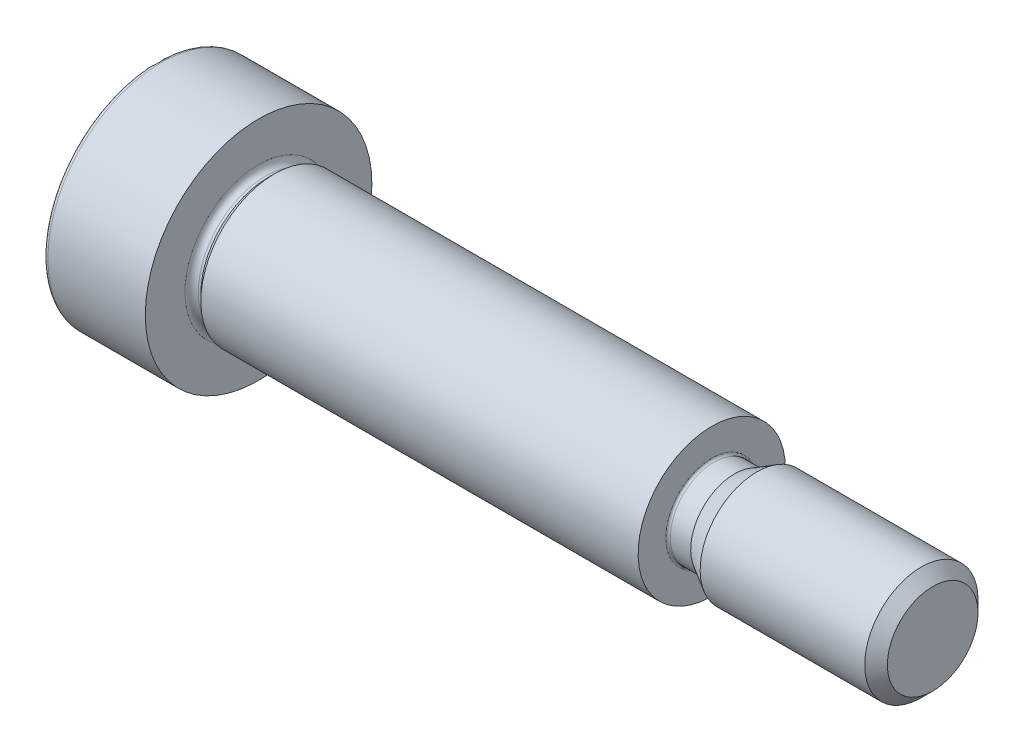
ISO-10303-21;
HEADER;
FILE_DESCRIPTION(('STEP AP214'),'2;1');
FILE_NAME('part.step','',(''),(''),'','','');
FILE_SCHEMA(('AUTOMOTIVE_DESIGN { 1 0 10303 214 1 1 1 1 }'));
ENDSEC;
DATA;
#1=APPLICATION_CONTEXT('core data for automotive mechanical design processes');
#2=APPLICATION_PROTOCOL_DEFINITION('international standard','automotive_design',2000,#1);
#3=PRODUCT_CONTEXT('',#1,'mechanical');
#4=PRODUCT('Part','Part','',(#3));
#5=PRODUCT_RELATED_PRODUCT_CATEGORY('part','',(#4));
#6=PRODUCT_DEFINITION_FORMATION('','',#4);
#7=PRODUCT_DEFINITION_CONTEXT('part definition',#1,'design');
#8=PRODUCT_DEFINITION('design','',#6,#7);
#9=PRODUCT_DEFINITION_SHAPE('','',#8);
#10=(LENGTH_UNIT() NAMED_UNIT(*) SI_UNIT(.MILLI.,.METRE.));
#11=(NAMED_UNIT(*) PLANE_ANGLE_UNIT() SI_UNIT($,.RADIAN.));
#12=(NAMED_UNIT(*) SI_UNIT($,.STERADIAN.) SOLID_ANGLE_UNIT());
#13=UNCERTAINTY_MEASURE_WITH_UNIT(LENGTH_MEASURE(1.E-05),#10,'distance_accuracy_value','');
#14=(GEOMETRIC_REPRESENTATION_CONTEXT(3) GLOBAL_UNCERTAINTY_ASSIGNED_CONTEXT((#13)) GLOBAL_UNIT_ASSIGNED_CONTEXT((#10,
#11,#12)) REPRESENTATION_CONTEXT('',''));
#15=CARTESIAN_POINT('',(0.,0.,0.));
#16=DIRECTION('',(0.,0.,1.));
#17=DIRECTION('',(1.,0.,0.));
#18=AXIS2_PLACEMENT_3D('',#15,#16,#17);
#19=CARTESIAN_POINT('',(24.5,0.,0.));
#20=DIRECTION('',(-1.,0.,0.));
#21=DIRECTION('',(0.,0.,1.));
#22=AXIS2_PLACEMENT_3D('',#19,#20,#21);
#23=CYLINDRICAL_SURFACE('',#22,3.25);
#24=CARTESIAN_POINT('',(4.5001667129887,0.,0.));
#25=DIRECTION('',(1.,0.,0.));
#26=DIRECTION('',(0.,1.,0.));
#27=AXIS2_PLACEMENT_3D('',#24,#25,#26);
#28=CIRCLE('',#27,3.25);
#29=CARTESIAN_POINT('',(4.5001667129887,3.25,0.));
#30=VERTEX_POINT('',#29);
#31=EDGE_CURVE('E159',#30,#30,#28,.F.);
#32=ORIENTED_EDGE('',*,*,#31,.T.);
#33=EDGE_LOOP('',(#32));
#34=FACE_BOUND('',#33,.T.);
#35=CARTESIAN_POINT('',(4.5,0.,0.));
#36=DIRECTION('',(1.,0.,0.));
#37=DIRECTION('',(0.,0.,-1.));
#38=AXIS2_PLACEMENT_3D('',#35,#36,#37);
#39=CIRCLE('',#38,3.25);
#40=CARTESIAN_POINT('',(4.5,0.,-3.25));
#41=VERTEX_POINT('',#40);
#42=EDGE_CURVE('E141',#41,#41,#39,.T.);
#43=ORIENTED_EDGE('',*,*,#42,.T.);
#44=EDGE_LOOP('',(#43));
#45=FACE_BOUND('',#44,.T.);
#46=ADVANCED_FACE('F43',(#34,#45),#23,.T.);
#47=CARTESIAN_POINT('',(0.,0.,0.));
#48=DIRECTION('',(1.,0.,0.));
#49=DIRECTION('',(0.,0.,-1.));
#50=AXIS2_PLACEMENT_3D('',#47,#48,#49);
#51=PLANE('',#50);
#52=CARTESIAN_POINT('',(0.,0.,0.));
#53=DIRECTION('',(1.,0.,0.));
#54=DIRECTION('',(0.,0.,-1.));
#55=AXIS2_PLACEMENT_3D('',#52,#53,#54);
#56=CIRCLE('',#55,4.8);
#57=CARTESIAN_POINT('',(0.,0.,-4.8));
#58=VERTEX_POINT('',#57);
#59=EDGE_CURVE('E11',#58,#58,#56,.F.);
#60=ORIENTED_EDGE('',*,*,#59,.T.);
#61=EDGE_LOOP('',(#60));
#62=FACE_BOUND('',#61,.T.);
#63=DIRECTION('',(0.,0.866025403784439,-0.5));
#64=VECTOR('',#63,1.);
#65=CARTESIAN_POINT('',(0.,-1.5,-0.86602540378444));
#66=LINE('',#65,#64);
#67=CARTESIAN_POINT('',(0.,-1.5,-0.86602540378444));
#68=VERTEX_POINT('',#67);
#69=CARTESIAN_POINT('',(0.,0.,-1.73205080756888));
#70=VERTEX_POINT('',#69);
#71=EDGE_CURVE('E59',#68,#70,#66,.T.);
#72=ORIENTED_EDGE('',*,*,#71,.T.);
#73=DIRECTION('',(0.,0.866025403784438,0.5));
#74=VECTOR('',#73,1.);
#75=CARTESIAN_POINT('',(0.,0.,-1.73205080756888));
#76=LINE('',#75,#74);
#77=CARTESIAN_POINT('',(0.,1.5,-0.866025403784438));
#78=VERTEX_POINT('',#77);
#79=EDGE_CURVE('E118',#70,#78,#76,.T.);
#80=ORIENTED_EDGE('',*,*,#79,.T.);
#81=DIRECTION('',(0.,0.,1.));
#82=VECTOR('',#81,1.);
#83=CARTESIAN_POINT('',(0.,1.5,-0.866025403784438));
#84=LINE('',#83,#82);
#85=CARTESIAN_POINT('',(0.,1.5,0.866025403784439));
#86=VERTEX_POINT('',#85);
#87=EDGE_CURVE('E116',#78,#86,#84,.T.);
#88=ORIENTED_EDGE('',*,*,#87,.T.);
#89=DIRECTION('',(0.,-0.866025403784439,0.5));
#90=VECTOR('',#89,1.);
#91=CARTESIAN_POINT('',(0.,1.5,0.866025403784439));
#92=LINE('',#91,#90);
#93=CARTESIAN_POINT('',(0.,0.,1.73205080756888));
#94=VERTEX_POINT('',#93);
#95=EDGE_CURVE('E93',#86,#94,#92,.T.);
#96=ORIENTED_EDGE('',*,*,#95,.T.);
#97=DIRECTION('',(0.,-0.866025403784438,-0.5));
#98=VECTOR('',#97,1.);
#99=CARTESIAN_POINT('',(0.,0.,1.73205080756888));
#100=LINE('',#99,#98);
#101=CARTESIAN_POINT('',(0.,-1.5,0.866025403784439));
#102=VERTEX_POINT('',#101);
#103=EDGE_CURVE('E102',#94,#102,#100,.T.);
#104=ORIENTED_EDGE('',*,*,#103,.T.);
#105=DIRECTION('',(0.,0.,-1.));
#106=VECTOR('',#105,1.);
#107=CARTESIAN_POINT('',(0.,-1.5,0.866025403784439));
#108=LINE('',#107,#106);
#109=EDGE_CURVE('E113',#102,#68,#108,.T.);
#110=ORIENTED_EDGE('',*,*,#109,.T.);
#111=EDGE_LOOP('',(#72,#80,#88,#96,#104,#110));
#112=FACE_BOUND('',#111,.T.);
#113=ADVANCED_FACE('F111',(#62,#112),#51,.F.);
#114=CARTESIAN_POINT('',(4.5,0.,0.));
#115=DIRECTION('',(1.,0.,0.));
#116=DIRECTION('',(0.,0.,-1.));
#117=AXIS2_PLACEMENT_3D('',#114,#115,#116);
#118=PLANE('',#117);
#119=CARTESIAN_POINT('',(4.5,0.,0.));
#120=DIRECTION('',(1.,0.,0.));
#121=DIRECTION('',(0.,0.,-1.));
#122=AXIS2_PLACEMENT_3D('',#119,#120,#121);
#123=CIRCLE('',#122,5.);
#124=CARTESIAN_POINT('',(4.5,0.,-5.));
#125=VERTEX_POINT('',#124);
#126=EDGE_CURVE('E138',#125,#125,#123,.T.);
#127=ORIENTED_EDGE('',*,*,#126,.T.);
#128=EDGE_LOOP('',(#127));
#129=FACE_BOUND('',#128,.T.);
#130=ORIENTED_EDGE('',*,*,#42,.F.);
#131=EDGE_LOOP('',(#130));
#132=FACE_BOUND('',#131,.T.);
#133=ADVANCED_FACE('F195',(#129,#132),#118,.T.);
#134=CARTESIAN_POINT('',(4.5,0.,0.));
#135=DIRECTION('',(-1.,0.,0.));
#136=DIRECTION('',(0.,0.,1.));
#137=AXIS2_PLACEMENT_3D('',#134,#135,#136);
#138=CYLINDRICAL_SURFACE('',#137,5.);
#139=CARTESIAN_POINT('',(0.2,0.,0.));
#140=DIRECTION('',(1.,0.,0.));
#141=DIRECTION('',(0.,0.,-1.));
#142=AXIS2_PLACEMENT_3D('',#139,#140,#141);
#143=CIRCLE('',#142,5.);
#144=CARTESIAN_POINT('',(0.2,0.,-5.));
#145=VERTEX_POINT('',#144);
#146=EDGE_CURVE('E51',#145,#145,#143,.T.);
#147=ORIENTED_EDGE('',*,*,#146,.T.);
#148=EDGE_LOOP('',(#147));
#149=FACE_BOUND('',#148,.T.);
#150=ORIENTED_EDGE('',*,*,#126,.F.);
#151=EDGE_LOOP('',(#150));
#152=FACE_BOUND('',#151,.T.);
#153=ADVANCED_FACE('F173',(#149,#152),#138,.T.);
#154=CARTESIAN_POINT('',(2.4,-1.5,-0.86602540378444));
#155=DIRECTION('',(0.,0.5,0.866025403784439));
#156=DIRECTION('',(0.,-0.866025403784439,0.5));
#157=AXIS2_PLACEMENT_3D('',#154,#155,#156);
#158=PLANE('',#157);
#159=ORIENTED_EDGE('',*,*,#71,.F.);
#160=DIRECTION('',(-1.,0.,0.));
#161=VECTOR('',#160,1.);
#162=CARTESIAN_POINT('',(2.4,-1.5,-0.86602540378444));
#163=LINE('',#162,#161);
#164=CARTESIAN_POINT('',(2.4,-1.5,-0.86602540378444));
#165=VERTEX_POINT('',#164);
#166=EDGE_CURVE('E122',#165,#68,#163,.T.);
#167=ORIENTED_EDGE('',*,*,#166,.F.);
#168=DIRECTION('',(0.,0.866025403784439,-0.5));
#169=VECTOR('',#168,1.);
#170=CARTESIAN_POINT('',(2.4,-1.5,-0.86602540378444));
#171=LINE('',#170,#169);
#172=CARTESIAN_POINT('',(2.4,0.,-1.73205080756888));
#173=VERTEX_POINT('',#172);
#174=EDGE_CURVE('E123',#165,#173,#171,.T.);
#175=ORIENTED_EDGE('',*,*,#174,.T.);
#176=DIRECTION('',(-1.,0.,0.));
#177=VECTOR('',#176,1.);
#178=CARTESIAN_POINT('',(2.4,0.,-1.73205080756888));
#179=LINE('',#178,#177);
#180=EDGE_CURVE('E132',#173,#70,#179,.T.);
#181=ORIENTED_EDGE('',*,*,#180,.T.);
#182=EDGE_LOOP('',(#159,#167,#175,#181));
#183=FACE_BOUND('',#182,.T.);
#184=ADVANCED_FACE('F266',(#183),#158,.T.);
#185=CARTESIAN_POINT('',(2.4,0.,-1.73205080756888));
#186=DIRECTION('',(0.,-0.5,0.866025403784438));
#187=DIRECTION('',(0.,-0.866025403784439,-0.5));
#188=AXIS2_PLACEMENT_3D('',#185,#186,#187);
#189=PLANE('',#188);
#190=ORIENTED_EDGE('',*,*,#79,.F.);
#191=ORIENTED_EDGE('',*,*,#180,.F.);
#192=DIRECTION('',(0.,0.866025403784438,0.5));
#193=VECTOR('',#192,1.);
#194=CARTESIAN_POINT('',(2.4,0.,-1.73205080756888));
#195=LINE('',#194,#193);
#196=CARTESIAN_POINT('',(2.4,1.5,-0.866025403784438));
#197=VERTEX_POINT('',#196);
#198=EDGE_CURVE('E486',#173,#197,#195,.T.);
#199=ORIENTED_EDGE('',*,*,#198,.T.);
#200=DIRECTION('',(-1.,0.,0.));
#201=VECTOR('',#200,1.);
#202=CARTESIAN_POINT('',(2.4,1.5,-0.866025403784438));
#203=LINE('',#202,#201);
#204=EDGE_CURVE('E128',#197,#78,#203,.T.);
#205=ORIENTED_EDGE('',*,*,#204,.T.);
#206=EDGE_LOOP('',(#190,#191,#199,#205));
#207=FACE_BOUND('',#206,.T.);
#208=ADVANCED_FACE('F265',(#207),#189,.T.);
#209=CARTESIAN_POINT('',(2.4,1.5,-0.866025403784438));
#210=DIRECTION('',(0.,-1.,0.));
#211=DIRECTION('',(0.,0.,-1.));
#212=AXIS2_PLACEMENT_3D('',#209,#210,#211);
#213=PLANE('',#212);
#214=ORIENTED_EDGE('',*,*,#87,.F.);
#215=ORIENTED_EDGE('',*,*,#204,.F.);
#216=DIRECTION('',(0.,0.,1.));
#217=VECTOR('',#216,1.);
#218=CARTESIAN_POINT('',(2.4,1.5,-0.866025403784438));
#219=LINE('',#218,#217);
#220=CARTESIAN_POINT('',(2.4,1.5,0.866025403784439));
#221=VERTEX_POINT('',#220);
#222=EDGE_CURVE('E67',#197,#221,#219,.T.);
#223=ORIENTED_EDGE('',*,*,#222,.T.);
#224=DIRECTION('',(-1.,0.,0.));
#225=VECTOR('',#224,1.);
#226=CARTESIAN_POINT('',(2.4,1.5,0.866025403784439));
#227=LINE('',#226,#225);
#228=EDGE_CURVE('E103',#221,#86,#227,.T.);
#229=ORIENTED_EDGE('',*,*,#228,.T.);
#230=EDGE_LOOP('',(#214,#215,#223,#229));
#231=FACE_BOUND('',#230,.T.);
#232=ADVANCED_FACE('F260',(#231),#213,.T.);
#233=CARTESIAN_POINT('',(2.4,1.5,0.866025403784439));
#234=DIRECTION('',(0.,-0.5,-0.866025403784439));
#235=DIRECTION('',(0.,0.866025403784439,-0.5));
#236=AXIS2_PLACEMENT_3D('',#233,#234,#235);
#237=PLANE('',#236);
#238=ORIENTED_EDGE('',*,*,#95,.F.);
#239=ORIENTED_EDGE('',*,*,#228,.F.);
#240=DIRECTION('',(0.,-0.866025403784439,0.5));
#241=VECTOR('',#240,1.);
#242=CARTESIAN_POINT('',(2.4,1.5,0.866025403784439));
#243=LINE('',#242,#241);
#244=CARTESIAN_POINT('',(2.4,0.,1.73205080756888));
#245=VERTEX_POINT('',#244);
#246=EDGE_CURVE('E96',#221,#245,#243,.T.);
#247=ORIENTED_EDGE('',*,*,#246,.T.);
#248=DIRECTION('',(-1.,0.,0.));
#249=VECTOR('',#248,1.);
#250=CARTESIAN_POINT('',(2.4,0.,1.73205080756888));
#251=LINE('',#250,#249);
#252=EDGE_CURVE('E86',#245,#94,#251,.T.);
#253=ORIENTED_EDGE('',*,*,#252,.T.);
#254=EDGE_LOOP('',(#238,#239,#247,#253));
#255=FACE_BOUND('',#254,.T.);
#256=ADVANCED_FACE('F91',(#255),#237,.T.);
#257=CARTESIAN_POINT('',(2.4,0.,1.73205080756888));
#258=DIRECTION('',(0.,0.5,-0.866025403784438));
#259=DIRECTION('',(0.,0.866025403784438,0.5));
#260=AXIS2_PLACEMENT_3D('',#257,#258,#259);
#261=PLANE('',#260);
#262=ORIENTED_EDGE('',*,*,#103,.F.);
#263=ORIENTED_EDGE('',*,*,#252,.F.);
#264=DIRECTION('',(0.,-0.866025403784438,-0.5));
#265=VECTOR('',#264,1.);
#266=CARTESIAN_POINT('',(2.4,0.,1.73205080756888));
#267=LINE('',#266,#265);
#268=CARTESIAN_POINT('',(2.4,-1.5,0.866025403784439));
#269=VERTEX_POINT('',#268);
#270=EDGE_CURVE('E485',#245,#269,#267,.T.);
#271=ORIENTED_EDGE('',*,*,#270,.T.);
#272=DIRECTION('',(-1.,0.,0.));
#273=VECTOR('',#272,1.);
#274=CARTESIAN_POINT('',(2.4,-1.5,0.866025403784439));
#275=LINE('',#274,#273);
#276=EDGE_CURVE('E105',#269,#102,#275,.T.);
#277=ORIENTED_EDGE('',*,*,#276,.T.);
#278=EDGE_LOOP('',(#262,#263,#271,#277));
#279=FACE_BOUND('',#278,.T.);
#280=ADVANCED_FACE('F108',(#279),#261,.T.);
#281=CARTESIAN_POINT('',(2.4,-1.5,0.866025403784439));
#282=DIRECTION('',(0.,1.,0.));
#283=DIRECTION('',(0.,0.,1.));
#284=AXIS2_PLACEMENT_3D('',#281,#282,#283);
#285=PLANE('',#284);
#286=ORIENTED_EDGE('',*,*,#109,.F.);
#287=ORIENTED_EDGE('',*,*,#276,.F.);
#288=DIRECTION('',(0.,0.,-1.));
#289=VECTOR('',#288,1.);
#290=CARTESIAN_POINT('',(2.4,-1.5,0.866025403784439));
#291=LINE('',#290,#289);
#292=EDGE_CURVE('E126',#269,#165,#291,.T.);
#293=ORIENTED_EDGE('',*,*,#292,.T.);
#294=ORIENTED_EDGE('',*,*,#166,.T.);
#295=EDGE_LOOP('',(#286,#287,#293,#294));
#296=FACE_BOUND('',#295,.T.);
#297=ADVANCED_FACE('F234',(#296),#285,.T.);
#298=CARTESIAN_POINT('',(2.4,1.5,0.866025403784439));
#299=DIRECTION('',(0.86602540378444,0.249999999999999,0.433012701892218));
#300=DIRECTION('',(0.447213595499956,0.,-0.894427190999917));
#301=AXIS2_PLACEMENT_3D('',#298,#299,#300);
#302=PLANE('',#301);
#303=ORIENTED_EDGE('',*,*,#246,.F.);
#304=DIRECTION('',(-0.447213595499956,0.774596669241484,0.447213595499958));
#305=VECTOR('',#304,1.);
#306=CARTESIAN_POINT('',(2.4,1.5,0.866025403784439));
#307=LINE('',#306,#305);
#308=CARTESIAN_POINT('',(3.26602540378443,0.,0.));
#309=VERTEX_POINT('',#308);
#310=EDGE_CURVE('E164',#309,#221,#307,.T.);
#311=ORIENTED_EDGE('',*,*,#310,.F.);
#312=DIRECTION('',(-0.447213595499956,0.,0.894427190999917));
#313=VECTOR('',#312,1.);
#314=CARTESIAN_POINT('',(2.4,0.,1.73205080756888));
#315=LINE('',#314,#313);
#316=EDGE_CURVE('E478',#309,#245,#315,.T.);
#317=ORIENTED_EDGE('',*,*,#316,.T.);
#318=EDGE_LOOP('',(#303,#311,#317));
#319=FACE_BOUND('',#318,.T.);
#320=ADVANCED_FACE('F227',(#319),#302,.F.);
#321=CARTESIAN_POINT('',(2.4,0.,1.73205080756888));
#322=DIRECTION('',(0.86602540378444,-0.249999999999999,0.433012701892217));
#323=DIRECTION('',(0.447213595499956,0.,-0.894427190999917));
#324=AXIS2_PLACEMENT_3D('',#321,#322,#323);
#325=PLANE('',#324);
#326=ORIENTED_EDGE('',*,*,#270,.F.);
#327=ORIENTED_EDGE('',*,*,#316,.F.);
#328=DIRECTION('',(-0.447213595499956,-0.774596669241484,0.447213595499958));
#329=VECTOR('',#328,1.);
#330=CARTESIAN_POINT('',(2.4,-1.5,0.866025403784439));
#331=LINE('',#330,#329);
#332=EDGE_CURVE('E479',#309,#269,#331,.T.);
#333=ORIENTED_EDGE('',*,*,#332,.T.);
#334=EDGE_LOOP('',(#326,#327,#333));
#335=FACE_BOUND('',#334,.T.);
#336=ADVANCED_FACE('F231',(#335),#325,.F.);
#337=CARTESIAN_POINT('',(2.4,-1.5,0.866025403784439));
#338=DIRECTION('',(0.86602540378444,-0.499999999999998,0.));
#339=DIRECTION('',(0.499999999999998,0.86602540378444,0.));
#340=AXIS2_PLACEMENT_3D('',#337,#338,#339);
#341=PLANE('',#340);
#342=ORIENTED_EDGE('',*,*,#292,.F.);
#343=ORIENTED_EDGE('',*,*,#332,.F.);
#344=DIRECTION('',(-0.447213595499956,-0.774596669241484,-0.447213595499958));
#345=VECTOR('',#344,1.);
#346=CARTESIAN_POINT('',(2.4,-1.5,-0.86602540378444));
#347=LINE('',#346,#345);
#348=EDGE_CURVE('E493',#309,#165,#347,.T.);
#349=ORIENTED_EDGE('',*,*,#348,.T.);
#350=EDGE_LOOP('',(#342,#343,#349));
#351=FACE_BOUND('',#350,.T.);
#352=ADVANCED_FACE('F243',(#351),#341,.F.);
#353=CARTESIAN_POINT('',(2.4,-1.5,-0.86602540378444));
#354=DIRECTION('',(0.86602540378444,-0.249999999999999,-0.433012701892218));
#355=DIRECTION('',(-0.447213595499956,0.,-0.894427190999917));
#356=AXIS2_PLACEMENT_3D('',#353,#354,#355);
#357=PLANE('',#356);
#358=ORIENTED_EDGE('',*,*,#174,.F.);
#359=ORIENTED_EDGE('',*,*,#348,.F.);
#360=DIRECTION('',(-0.447213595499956,0.,-0.894427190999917));
#361=VECTOR('',#360,1.);
#362=CARTESIAN_POINT('',(2.4,0.,-1.73205080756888));
#363=LINE('',#362,#361);
#364=EDGE_CURVE('E496',#309,#173,#363,.T.);
#365=ORIENTED_EDGE('',*,*,#364,.T.);
#366=EDGE_LOOP('',(#358,#359,#365));
#367=FACE_BOUND('',#366,.T.);
#368=ADVANCED_FACE('F238',(#367),#357,.F.);
#369=CARTESIAN_POINT('',(2.4,0.,-1.73205080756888));
#370=DIRECTION('',(0.86602540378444,0.249999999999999,-0.433012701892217));
#371=DIRECTION('',(-0.447213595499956,0.,-0.894427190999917));
#372=AXIS2_PLACEMENT_3D('',#369,#370,#371);
#373=PLANE('',#372);
#374=ORIENTED_EDGE('',*,*,#198,.F.);
#375=ORIENTED_EDGE('',*,*,#364,.F.);
#376=DIRECTION('',(-0.447213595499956,0.774596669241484,-0.447213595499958));
#377=VECTOR('',#376,1.);
#378=CARTESIAN_POINT('',(2.4,1.5,-0.866025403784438));
#379=LINE('',#378,#377);
#380=EDGE_CURVE('E497',#309,#197,#379,.T.);
#381=ORIENTED_EDGE('',*,*,#380,.T.);
#382=EDGE_LOOP('',(#374,#375,#381));
#383=FACE_BOUND('',#382,.T.);
#384=ADVANCED_FACE('F240',(#383),#373,.F.);
#385=CARTESIAN_POINT('',(2.4,1.5,-0.866025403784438));
#386=DIRECTION('',(0.86602540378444,0.499999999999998,0.));
#387=DIRECTION('',(-0.499999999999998,0.86602540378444,0.));
#388=AXIS2_PLACEMENT_3D('',#385,#386,#387);
#389=PLANE('',#388);
#390=ORIENTED_EDGE('',*,*,#222,.F.);
#391=ORIENTED_EDGE('',*,*,#380,.F.);
#392=ORIENTED_EDGE('',*,*,#310,.T.);
#393=EDGE_LOOP('',(#390,#391,#392));
#394=FACE_BOUND('',#393,.T.);
#395=ADVANCED_FACE('F224',(#394),#389,.F.);
#396=CARTESIAN_POINT('',(4.8,0.,0.));
#397=DIRECTION('',(1.,0.,0.));
#398=DIRECTION('',(0.,1.,0.));
#399=AXIS2_PLACEMENT_3D('',#396,#397,#398);
#400=TOROIDAL_SURFACE('',#399,3.26,0.3);
#401=CARTESIAN_POINT('',(4.8,0.,0.));
#402=DIRECTION('',(1.,0.,0.));
#403=DIRECTION('',(0.,1.,0.));
#404=AXIS2_PLACEMENT_3D('',#401,#402,#403);
#405=CIRCLE('',#404,2.96);
#406=CARTESIAN_POINT('',(4.8,2.96,0.));
#407=VERTEX_POINT('',#406);
#408=EDGE_CURVE('E158',#407,#407,#405,.T.);
#409=ORIENTED_EDGE('',*,*,#408,.F.);
#410=EDGE_LOOP('',(#409));
#411=FACE_BOUND('',#410,.T.);
#412=ORIENTED_EDGE('',*,*,#31,.F.);
#413=EDGE_LOOP('',(#412));
#414=FACE_BOUND('',#413,.T.);
#415=ADVANCED_FACE('F216',(#411,#414),#400,.F.);
#416=CARTESIAN_POINT('',(4.91022213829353,0.,0.));
#417=DIRECTION('',(1.,0.,0.));
#418=DIRECTION('',(0.,1.,0.));
#419=AXIS2_PLACEMENT_3D('',#416,#417,#418);
#420=CONICAL_SURFACE('',#419,2.96,0.78539816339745);
#421=CARTESIAN_POINT('',(4.91022213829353,0.,0.));
#422=DIRECTION('',(1.,0.,0.));
#423=DIRECTION('',(0.,1.,0.));
#424=AXIS2_PLACEMENT_3D('',#421,#422,#423);
#425=CIRCLE('',#424,2.96);
#426=CARTESIAN_POINT('',(4.91022213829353,2.96,0.));
#427=VERTEX_POINT('',#426);
#428=EDGE_CURVE('E503',#427,#427,#425,.T.);
#429=ORIENTED_EDGE('',*,*,#428,.T.);
#430=EDGE_LOOP('',(#429));
#431=FACE_BOUND('',#430,.T.);
#432=CARTESIAN_POINT('',(5.20022213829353,0.,0.));
#433=DIRECTION('',(1.,0.,0.));
#434=DIRECTION('',(0.,1.,0.));
#435=AXIS2_PLACEMENT_3D('',#432,#433,#434);
#436=CIRCLE('',#435,3.25);
#437=CARTESIAN_POINT('',(5.20022213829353,3.25,0.));
#438=VERTEX_POINT('',#437);
#439=EDGE_CURVE('E157',#438,#438,#436,.T.);
#440=ORIENTED_EDGE('',*,*,#439,.F.);
#441=EDGE_LOOP('',(#440));
#442=FACE_BOUND('',#441,.T.);
#443=ADVANCED_FACE('F214',(#431,#442),#420,.T.);
#444=CARTESIAN_POINT('',(12.5320641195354,0.,0.));
#445=DIRECTION('',(1.,0.,0.));
#446=DIRECTION('',(0.,1.,0.));
#447=AXIS2_PLACEMENT_3D('',#444,#445,#446);
#448=CYLINDRICAL_SURFACE('',#447,2.96);
#449=ORIENTED_EDGE('',*,*,#428,.F.);
#450=EDGE_LOOP('',(#449));
#451=FACE_BOUND('',#450,.T.);
#452=ORIENTED_EDGE('',*,*,#408,.T.);
#453=EDGE_LOOP('',(#452));
#454=FACE_BOUND('',#453,.T.);
#455=ADVANCED_FACE('F213',(#451,#454),#448,.T.);
#456=CARTESIAN_POINT('',(34.25,0.,0.));
#457=DIRECTION('',(1.,0.,0.));
#458=DIRECTION('',(0.,0.,-1.));
#459=AXIS2_PLACEMENT_3D('',#456,#457,#458);
#460=PLANE('',#459);
#461=CARTESIAN_POINT('',(34.25,0.,0.));
#462=DIRECTION('',(1.,0.,0.));
#463=DIRECTION('',(0.,0.,-1.));
#464=AXIS2_PLACEMENT_3D('',#461,#462,#463);
#465=CIRCLE('',#464,1.99999999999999);
#466=CARTESIAN_POINT('',(34.25,0.,-1.99999999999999));
#467=VERTEX_POINT('',#466);
#468=EDGE_CURVE('E152',#467,#467,#465,.T.);
#469=ORIENTED_EDGE('',*,*,#468,.T.);
#470=EDGE_LOOP('',(#469));
#471=FACE_BOUND('',#470,.T.);
#472=ADVANCED_FACE('F225',(#471),#460,.T.);
#473=CARTESIAN_POINT('',(34.25,0.,0.));
#474=DIRECTION('',(-1.,0.,0.));
#475=DIRECTION('',(0.,0.,1.));
#476=AXIS2_PLACEMENT_3D('',#473,#474,#475);
#477=CYLINDRICAL_SURFACE('',#476,2.5);
#478=CARTESIAN_POINT('',(33.75,0.,0.));
#479=DIRECTION('',(1.,0.,0.));
#480=DIRECTION('',(0.,0.,-1.));
#481=AXIS2_PLACEMENT_3D('',#478,#479,#480);
#482=CIRCLE('',#481,2.5);
#483=CARTESIAN_POINT('',(33.75,0.,-2.5));
#484=VERTEX_POINT('',#483);
#485=EDGE_CURVE('E166',#484,#484,#482,.F.);
#486=ORIENTED_EDGE('',*,*,#485,.T.);
#487=EDGE_LOOP('',(#486));
#488=FACE_BOUND('',#487,.T.);
#489=CARTESIAN_POINT('',(26.4872689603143,0.,0.));
#490=DIRECTION('',(1.,0.,0.));
#491=DIRECTION('',(0.,1.,0.));
#492=AXIS2_PLACEMENT_3D('',#489,#490,#491);
#493=CIRCLE('',#492,2.5);
#494=CARTESIAN_POINT('',(26.4872689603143,2.5,0.));
#495=VERTEX_POINT('',#494);
#496=EDGE_CURVE('E137',#495,#495,#493,.T.);
#497=ORIENTED_EDGE('',*,*,#496,.T.);
#498=EDGE_LOOP('',(#497));
#499=FACE_BOUND('',#498,.T.);
#500=ADVANCED_FACE('F272',(#488,#499),#477,.T.);
#501=CARTESIAN_POINT('',(25.5,0.,0.));
#502=DIRECTION('',(1.,0.,0.));
#503=DIRECTION('',(0.,1.,0.));
#504=AXIS2_PLACEMENT_3D('',#501,#502,#503);
#505=CONICAL_SURFACE('',#504,1.93,0.523598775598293);
#506=CARTESIAN_POINT('',(25.5,0.,0.));
#507=DIRECTION('',(1.,0.,0.));
#508=DIRECTION('',(0.,1.,0.));
#509=AXIS2_PLACEMENT_3D('',#506,#507,#508);
#510=CIRCLE('',#509,1.93);
#511=CARTESIAN_POINT('',(25.5,1.93,0.));
#512=VERTEX_POINT('',#511);
#513=EDGE_CURVE('E134',#512,#512,#510,.T.);
#514=ORIENTED_EDGE('',*,*,#513,.T.);
#515=EDGE_LOOP('',(#514));
#516=FACE_BOUND('',#515,.T.);
#517=ORIENTED_EDGE('',*,*,#496,.F.);
#518=EDGE_LOOP('',(#517));
#519=FACE_BOUND('',#518,.T.);
#520=ADVANCED_FACE('F269',(#516,#519),#505,.T.);
#521=CARTESIAN_POINT('',(13.0280306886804,0.,0.));
#522=DIRECTION('',(1.,0.,0.));
#523=DIRECTION('',(0.,1.,0.));
#524=AXIS2_PLACEMENT_3D('',#521,#522,#523);
#525=CYLINDRICAL_SURFACE('',#524,1.93);
#526=CARTESIAN_POINT('',(24.6,0.,0.));
#527=DIRECTION('',(1.,0.,0.));
#528=DIRECTION('',(0.,0.,-1.));
#529=AXIS2_PLACEMENT_3D('',#526,#527,#528);
#530=CIRCLE('',#529,1.93);
#531=CARTESIAN_POINT('',(24.6,0.,-1.93));
#532=VERTEX_POINT('',#531);
#533=EDGE_CURVE('E150',#532,#532,#530,.T.);
#534=ORIENTED_EDGE('',*,*,#533,.T.);
#535=EDGE_LOOP('',(#534));
#536=FACE_BOUND('',#535,.T.);
#537=ORIENTED_EDGE('',*,*,#513,.F.);
#538=EDGE_LOOP('',(#537));
#539=FACE_BOUND('',#538,.T.);
#540=ADVANCED_FACE('F273',(#536,#539),#525,.T.);
#541=CARTESIAN_POINT('',(24.6,0.,0.));
#542=DIRECTION('',(1.,0.,0.));
#543=DIRECTION('',(0.,0.,-1.));
#544=AXIS2_PLACEMENT_3D('',#541,#542,#543);
#545=TOROIDAL_SURFACE('',#544,2.03,0.1);
#546=CARTESIAN_POINT('',(24.5,0.,0.));
#547=DIRECTION('',(1.,0.,0.));
#548=DIRECTION('',(0.,0.,-1.));
#549=AXIS2_PLACEMENT_3D('',#546,#547,#548);
#550=CIRCLE('',#549,2.03);
#551=CARTESIAN_POINT('',(24.5,0.,-2.03));
#552=VERTEX_POINT('',#551);
#553=EDGE_CURVE('E155',#552,#552,#550,.F.);
#554=ORIENTED_EDGE('',*,*,#553,.F.);
#555=EDGE_LOOP('',(#554));
#556=FACE_BOUND('',#555,.T.);
#557=ORIENTED_EDGE('',*,*,#533,.F.);
#558=EDGE_LOOP('',(#557));
#559=FACE_BOUND('',#558,.T.);
#560=ADVANCED_FACE('F207',(#556,#559),#545,.F.);
#561=CARTESIAN_POINT('',(24.5,0.,0.));
#562=DIRECTION('',(1.,0.,0.));
#563=DIRECTION('',(0.,0.,-1.));
#564=AXIS2_PLACEMENT_3D('',#561,#562,#563);
#565=PLANE('',#564);
#566=ORIENTED_EDGE('',*,*,#553,.T.);
#567=EDGE_LOOP('',(#566));
#568=FACE_BOUND('',#567,.T.);
#569=CARTESIAN_POINT('',(24.5,0.,0.));
#570=DIRECTION('',(1.,0.,0.));
#571=DIRECTION('',(0.,0.,-1.));
#572=AXIS2_PLACEMENT_3D('',#569,#570,#571);
#573=CIRCLE('',#572,3.25);
#574=CARTESIAN_POINT('',(24.5,0.,-3.25));
#575=VERTEX_POINT('',#574);
#576=EDGE_CURVE('E140',#575,#575,#573,.T.);
#577=ORIENTED_EDGE('',*,*,#576,.T.);
#578=EDGE_LOOP('',(#577));
#579=FACE_BOUND('',#578,.T.);
#580=ADVANCED_FACE('F197',(#568,#579),#565,.T.);
#581=ORIENTED_EDGE('',*,*,#439,.T.);
#582=EDGE_LOOP('',(#581));
#583=FACE_BOUND('',#582,.T.);
#584=ORIENTED_EDGE('',*,*,#576,.F.);
#585=EDGE_LOOP('',(#584));
#586=FACE_BOUND('',#585,.T.);
#587=ADVANCED_FACE('F183',(#583,#586),#23,.T.);
#588=CARTESIAN_POINT('',(34.25,0.,0.));
#589=DIRECTION('',(-1.,0.,0.));
#590=DIRECTION('',(0.,0.,1.));
#591=AXIS2_PLACEMENT_3D('',#588,#589,#590);
#592=CONICAL_SURFACE('',#591,1.99999999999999,0.785398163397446);
#593=ORIENTED_EDGE('',*,*,#485,.F.);
#594=EDGE_LOOP('',(#593));
#595=FACE_BOUND('',#594,.T.);
#596=ORIENTED_EDGE('',*,*,#468,.F.);
#597=EDGE_LOOP('',(#596));
#598=FACE_BOUND('',#597,.T.);
#599=ADVANCED_FACE('F174',(#595,#598),#592,.T.);
#600=CARTESIAN_POINT('',(0.2,0.,0.));
#601=DIRECTION('',(1.,0.,0.));
#602=DIRECTION('',(0.,0.,-1.));
#603=AXIS2_PLACEMENT_3D('',#600,#601,#602);
#604=TOROIDAL_SURFACE('',#603,4.8,0.2);
#605=ORIENTED_EDGE('',*,*,#59,.F.);
#606=EDGE_LOOP('',(#605));
#607=FACE_BOUND('',#606,.T.);
#608=ORIENTED_EDGE('',*,*,#146,.F.);
#609=EDGE_LOOP('',(#608));
#610=FACE_BOUND('',#609,.T.);
#611=ADVANCED_FACE('F44',(#607,#610),#604,.T.);
#612=CLOSED_SHELL('',(#46,#113,#133,#153,#184,#208,#232,#256,#280,#297,#320,#336,#352,#368,#384,
#395,#415,#443,#455,#472,#500,#520,#540,#560,#580,#587,#599,#611));
#613=MANIFOLD_SOLID_BREP('B2',#612);
#614=ADVANCED_BREP_SHAPE_REPRESENTATION('',(#18,#613),#14);
#615=SHAPE_DEFINITION_REPRESENTATION(#9,#614);
ENDSEC;
END-ISO-10303-21;
